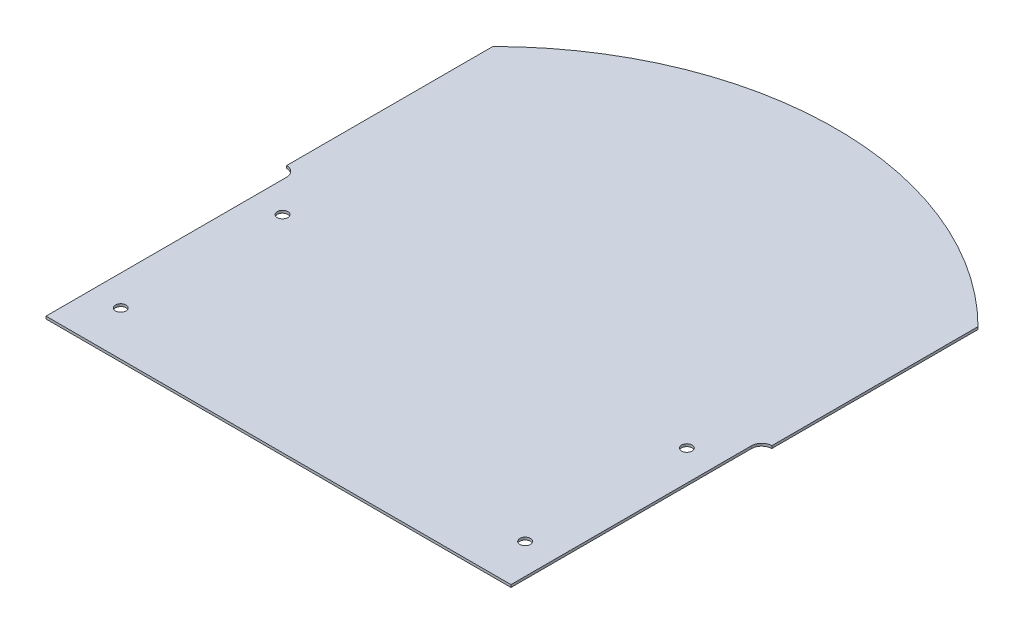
ISO-10303-21;
HEADER;
FILE_DESCRIPTION(('STEP AP214'),'2;1');
FILE_NAME('part.step','',(''),(''),'','','');
FILE_SCHEMA(('AUTOMOTIVE_DESIGN { 1 0 10303 214 1 1 1 1 }'));
ENDSEC;
DATA;
#1=APPLICATION_CONTEXT('core data for automotive mechanical design processes');
#2=APPLICATION_PROTOCOL_DEFINITION('international standard','automotive_design',2000,#1);
#3=PRODUCT_CONTEXT('',#1,'mechanical');
#4=PRODUCT('Part','Part','',(#3));
#5=PRODUCT_RELATED_PRODUCT_CATEGORY('part','',(#4));
#6=PRODUCT_DEFINITION_FORMATION('','',#4);
#7=PRODUCT_DEFINITION_CONTEXT('part definition',#1,'design');
#8=PRODUCT_DEFINITION('design','',#6,#7);
#9=PRODUCT_DEFINITION_SHAPE('','',#8);
#10=(LENGTH_UNIT() NAMED_UNIT(*) SI_UNIT(.MILLI.,.METRE.));
#11=(NAMED_UNIT(*) PLANE_ANGLE_UNIT() SI_UNIT($,.RADIAN.));
#12=(NAMED_UNIT(*) SI_UNIT($,.STERADIAN.) SOLID_ANGLE_UNIT());
#13=UNCERTAINTY_MEASURE_WITH_UNIT(LENGTH_MEASURE(1.E-05),#10,'distance_accuracy_value','');
#14=(GEOMETRIC_REPRESENTATION_CONTEXT(3) GLOBAL_UNCERTAINTY_ASSIGNED_CONTEXT((#13)) GLOBAL_UNIT_ASSIGNED_CONTEXT((#10,
#11,#12)) REPRESENTATION_CONTEXT('',''));
#15=CARTESIAN_POINT('',(0.,0.,0.));
#16=DIRECTION('',(0.,0.,1.));
#17=DIRECTION('',(1.,0.,0.));
#18=AXIS2_PLACEMENT_3D('',#15,#16,#17);
#19=CARTESIAN_POINT('',(-76.2,0.79375,39.37));
#20=DIRECTION('',(0.,0.,-1.));
#21=DIRECTION('',(-1.,0.,0.));
#22=AXIS2_PLACEMENT_3D('',#19,#20,#21);
#23=PLANE('',#22);
#24=DIRECTION('',(0.,-1.,0.));
#25=VECTOR('',#24,1.);
#26=CARTESIAN_POINT('',(73.025,0.79375,39.37));
#27=LINE('',#26,#25);
#28=CARTESIAN_POINT('',(73.025,0.79375,39.37));
#29=VERTEX_POINT('',#28);
#30=CARTESIAN_POINT('',(73.025,0.,39.37));
#31=VERTEX_POINT('',#30);
#32=EDGE_CURVE('E125',#29,#31,#27,.T.);
#33=ORIENTED_EDGE('',*,*,#32,.F.);
#34=DIRECTION('',(1.,0.,0.));
#35=VECTOR('',#34,1.);
#36=CARTESIAN_POINT('',(-76.2,0.79375,39.37));
#37=LINE('',#36,#35);
#38=CARTESIAN_POINT('',(-73.025,0.79375,39.37));
#39=VERTEX_POINT('',#38);
#40=EDGE_CURVE('E121',#39,#29,#37,.T.);
#41=ORIENTED_EDGE('',*,*,#40,.F.);
#42=DIRECTION('',(0.,-1.,0.));
#43=VECTOR('',#42,1.);
#44=CARTESIAN_POINT('',(-73.025,0.79375,39.37));
#45=LINE('',#44,#43);
#46=CARTESIAN_POINT('',(-73.025,0.,39.37));
#47=VERTEX_POINT('',#46);
#48=EDGE_CURVE('E137',#39,#47,#45,.T.);
#49=ORIENTED_EDGE('',*,*,#48,.T.);
#50=DIRECTION('',(1.,0.,0.));
#51=VECTOR('',#50,1.);
#52=CARTESIAN_POINT('',(-76.2,0.,39.37));
#53=LINE('',#52,#51);
#54=EDGE_CURVE('E162',#47,#31,#53,.T.);
#55=ORIENTED_EDGE('',*,*,#54,.T.);
#56=EDGE_LOOP('',(#33,#41,#49,#55));
#57=FACE_BOUND('',#56,.T.);
#58=ADVANCED_FACE('F35',(#57),#23,.F.);
#59=CARTESIAN_POINT('',(0.,0.79375,-27.9399999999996));
#60=DIRECTION('',(0.,1.,0.));
#61=DIRECTION('',(0.,0.,1.));
#62=AXIS2_PLACEMENT_3D('',#59,#60,#61);
#63=PLANE('',#62);
#64=CARTESIAN_POINT('',(63.5,0.79375,25.4));
#65=DIRECTION('',(0.,1.,0.));
#66=DIRECTION('',(0.,0.,1.));
#67=AXIS2_PLACEMENT_3D('',#64,#65,#66);
#68=CIRCLE('',#67,1.65100000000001);
#69=CARTESIAN_POINT('',(63.5,0.79375,27.051));
#70=VERTEX_POINT('',#69);
#71=EDGE_CURVE('E140',#70,#70,#68,.T.);
#72=ORIENTED_EDGE('',*,*,#71,.F.);
#73=EDGE_LOOP('',(#72));
#74=FACE_BOUND('',#73,.T.);
#75=CARTESIAN_POINT('',(63.5,0.79375,-25.4));
#76=DIRECTION('',(0.,1.,0.));
#77=DIRECTION('',(0.,0.,1.));
#78=AXIS2_PLACEMENT_3D('',#75,#76,#77);
#79=CIRCLE('',#78,1.65100000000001);
#80=CARTESIAN_POINT('',(63.5,0.79375,-23.749));
#81=VERTEX_POINT('',#80);
#82=EDGE_CURVE('E144',#81,#81,#79,.T.);
#83=ORIENTED_EDGE('',*,*,#82,.F.);
#84=EDGE_LOOP('',(#83));
#85=FACE_BOUND('',#84,.T.);
#86=CARTESIAN_POINT('',(-63.5,0.79375,-25.4));
#87=DIRECTION('',(0.,1.,0.));
#88=DIRECTION('',(0.,0.,1.));
#89=AXIS2_PLACEMENT_3D('',#86,#87,#88);
#90=CIRCLE('',#89,1.651);
#91=CARTESIAN_POINT('',(-63.5,0.79375,-23.749));
#92=VERTEX_POINT('',#91);
#93=EDGE_CURVE('E150',#92,#92,#90,.T.);
#94=ORIENTED_EDGE('',*,*,#93,.F.);
#95=EDGE_LOOP('',(#94));
#96=FACE_BOUND('',#95,.T.);
#97=CARTESIAN_POINT('',(-63.5,0.79375,25.4));
#98=DIRECTION('',(0.,1.,0.));
#99=DIRECTION('',(0.,0.,1.));
#100=AXIS2_PLACEMENT_3D('',#97,#98,#99);
#101=CIRCLE('',#100,1.651);
#102=CARTESIAN_POINT('',(-63.5,0.79375,27.051));
#103=VERTEX_POINT('',#102);
#104=EDGE_CURVE('E159',#103,#103,#101,.T.);
#105=ORIENTED_EDGE('',*,*,#104,.F.);
#106=EDGE_LOOP('',(#105));
#107=FACE_BOUND('',#106,.T.);
#108=DIRECTION('',(0.,0.,1.));
#109=VECTOR('',#108,1.);
#110=CARTESIAN_POINT('',(73.025,0.79375,-39.37));
#111=LINE('',#110,#109);
#112=CARTESIAN_POINT('',(73.025,0.79375,-36.195));
#113=VERTEX_POINT('',#112);
#114=EDGE_CURVE('E106',#113,#29,#111,.T.);
#115=ORIENTED_EDGE('',*,*,#114,.F.);
#116=CARTESIAN_POINT('',(76.2,0.79375,-36.195));
#117=DIRECTION('',(0.,1.,0.));
#118=DIRECTION('',(0.,0.,1.));
#119=AXIS2_PLACEMENT_3D('',#116,#117,#118);
#120=CIRCLE('',#119,3.175);
#121=CARTESIAN_POINT('',(76.2,0.79375,-39.37));
#122=VERTEX_POINT('',#121);
#123=EDGE_CURVE('E99',#113,#122,#120,.F.);
#124=ORIENTED_EDGE('',*,*,#123,.T.);
#125=DIRECTION('',(0.,0.,-1.));
#126=VECTOR('',#125,1.);
#127=CARTESIAN_POINT('',(76.2,0.79375,39.37));
#128=LINE('',#127,#126);
#129=CARTESIAN_POINT('',(76.2,0.79375,-104.14));
#130=VERTEX_POINT('',#129);
#131=EDGE_CURVE('E103',#122,#130,#128,.T.);
#132=ORIENTED_EDGE('',*,*,#131,.T.);
#133=CARTESIAN_POINT('',(0.,0.79375,-27.9399999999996));
#134=DIRECTION('',(0.,1.,0.));
#135=DIRECTION('',(0.,0.,1.));
#136=AXIS2_PLACEMENT_3D('',#133,#134,#135);
#137=CIRCLE('',#136,107.76307345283);
#138=CARTESIAN_POINT('',(-76.2,0.79375,-104.14));
#139=VERTEX_POINT('',#138);
#140=EDGE_CURVE('E120',#130,#139,#137,.T.);
#141=ORIENTED_EDGE('',*,*,#140,.T.);
#142=DIRECTION('',(0.,0.,-1.));
#143=VECTOR('',#142,1.);
#144=CARTESIAN_POINT('',(-76.2,0.79375,39.37));
#145=LINE('',#144,#143);
#146=CARTESIAN_POINT('',(-76.2,0.79375,-39.37));
#147=VERTEX_POINT('',#146);
#148=EDGE_CURVE('E168',#147,#139,#145,.T.);
#149=ORIENTED_EDGE('',*,*,#148,.F.);
#150=CARTESIAN_POINT('',(-76.2,0.79375,-36.195));
#151=DIRECTION('',(0.,1.,0.));
#152=DIRECTION('',(0.,0.,1.));
#153=AXIS2_PLACEMENT_3D('',#150,#151,#152);
#154=CIRCLE('',#153,3.175);
#155=CARTESIAN_POINT('',(-73.025,0.79375,-36.195));
#156=VERTEX_POINT('',#155);
#157=EDGE_CURVE('E11',#147,#156,#154,.F.);
#158=ORIENTED_EDGE('',*,*,#157,.T.);
#159=DIRECTION('',(0.,0.,-1.));
#160=VECTOR('',#159,1.);
#161=CARTESIAN_POINT('',(-73.025,0.79375,-39.37));
#162=LINE('',#161,#160);
#163=EDGE_CURVE('E128',#39,#156,#162,.T.);
#164=ORIENTED_EDGE('',*,*,#163,.F.);
#165=ORIENTED_EDGE('',*,*,#40,.T.);
#166=EDGE_LOOP('',(#115,#124,#132,#141,#149,#158,#164,#165));
#167=FACE_BOUND('',#166,.T.);
#168=ADVANCED_FACE('F101',(#74,#85,#96,#107,#167),#63,.T.);
#169=CARTESIAN_POINT('',(0.,0.,-27.9399999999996));
#170=DIRECTION('',(0.,1.,0.));
#171=DIRECTION('',(0.,0.,1.));
#172=AXIS2_PLACEMENT_3D('',#169,#170,#171);
#173=PLANE('',#172);
#174=CARTESIAN_POINT('',(63.5,0.,25.4));
#175=DIRECTION('',(0.,1.,0.));
#176=DIRECTION('',(0.,0.,1.));
#177=AXIS2_PLACEMENT_3D('',#174,#175,#176);
#178=CIRCLE('',#177,1.65100000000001);
#179=CARTESIAN_POINT('',(63.5,0.,27.051));
#180=VERTEX_POINT('',#179);
#181=EDGE_CURVE('E141',#180,#180,#178,.T.);
#182=ORIENTED_EDGE('',*,*,#181,.T.);
#183=EDGE_LOOP('',(#182));
#184=FACE_BOUND('',#183,.T.);
#185=CARTESIAN_POINT('',(63.5,0.,-25.4));
#186=DIRECTION('',(0.,1.,0.));
#187=DIRECTION('',(0.,0.,1.));
#188=AXIS2_PLACEMENT_3D('',#185,#186,#187);
#189=CIRCLE('',#188,1.65100000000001);
#190=CARTESIAN_POINT('',(63.5,0.,-23.749));
#191=VERTEX_POINT('',#190);
#192=EDGE_CURVE('E147',#191,#191,#189,.T.);
#193=ORIENTED_EDGE('',*,*,#192,.T.);
#194=EDGE_LOOP('',(#193));
#195=FACE_BOUND('',#194,.T.);
#196=CARTESIAN_POINT('',(-63.5,0.,-25.4));
#197=DIRECTION('',(0.,1.,0.));
#198=DIRECTION('',(0.,0.,1.));
#199=AXIS2_PLACEMENT_3D('',#196,#197,#198);
#200=CIRCLE('',#199,1.651);
#201=CARTESIAN_POINT('',(-63.5,0.,-23.749));
#202=VERTEX_POINT('',#201);
#203=EDGE_CURVE('E153',#202,#202,#200,.T.);
#204=ORIENTED_EDGE('',*,*,#203,.T.);
#205=EDGE_LOOP('',(#204));
#206=FACE_BOUND('',#205,.T.);
#207=CARTESIAN_POINT('',(-63.5,0.,25.4));
#208=DIRECTION('',(0.,1.,0.));
#209=DIRECTION('',(0.,0.,1.));
#210=AXIS2_PLACEMENT_3D('',#207,#208,#209);
#211=CIRCLE('',#210,1.651);
#212=CARTESIAN_POINT('',(-63.5,0.,27.051));
#213=VERTEX_POINT('',#212);
#214=EDGE_CURVE('E156',#213,#213,#211,.T.);
#215=ORIENTED_EDGE('',*,*,#214,.T.);
#216=EDGE_LOOP('',(#215));
#217=FACE_BOUND('',#216,.T.);
#218=DIRECTION('',(0.,0.,-1.));
#219=VECTOR('',#218,1.);
#220=CARTESIAN_POINT('',(76.2,0.,39.37));
#221=LINE('',#220,#219);
#222=CARTESIAN_POINT('',(76.2,0.,-39.37));
#223=VERTEX_POINT('',#222);
#224=CARTESIAN_POINT('',(76.2,0.,-104.14));
#225=VERTEX_POINT('',#224);
#226=EDGE_CURVE('E173',#223,#225,#221,.T.);
#227=ORIENTED_EDGE('',*,*,#226,.F.);
#228=CARTESIAN_POINT('',(76.2,0.,-36.195));
#229=DIRECTION('',(0.,1.,0.));
#230=DIRECTION('',(0.,0.,1.));
#231=AXIS2_PLACEMENT_3D('',#228,#229,#230);
#232=CIRCLE('',#231,3.175);
#233=CARTESIAN_POINT('',(73.025,0.,-36.195));
#234=VERTEX_POINT('',#233);
#235=EDGE_CURVE('E110',#223,#234,#232,.T.);
#236=ORIENTED_EDGE('',*,*,#235,.T.);
#237=DIRECTION('',(0.,0.,1.));
#238=VECTOR('',#237,1.);
#239=CARTESIAN_POINT('',(73.025,0.,-39.37));
#240=LINE('',#239,#238);
#241=EDGE_CURVE('E202',#234,#31,#240,.T.);
#242=ORIENTED_EDGE('',*,*,#241,.T.);
#243=ORIENTED_EDGE('',*,*,#54,.F.);
#244=DIRECTION('',(0.,0.,-1.));
#245=VECTOR('',#244,1.);
#246=CARTESIAN_POINT('',(-73.025,0.,-39.37));
#247=LINE('',#246,#245);
#248=CARTESIAN_POINT('',(-73.025,0.,-36.195));
#249=VERTEX_POINT('',#248);
#250=EDGE_CURVE('E124',#47,#249,#247,.T.);
#251=ORIENTED_EDGE('',*,*,#250,.T.);
#252=CARTESIAN_POINT('',(-76.2,0.,-36.195));
#253=DIRECTION('',(0.,1.,0.));
#254=DIRECTION('',(0.,0.,1.));
#255=AXIS2_PLACEMENT_3D('',#252,#253,#254);
#256=CIRCLE('',#255,3.175);
#257=CARTESIAN_POINT('',(-76.2,0.,-39.37));
#258=VERTEX_POINT('',#257);
#259=EDGE_CURVE('E43',#249,#258,#256,.T.);
#260=ORIENTED_EDGE('',*,*,#259,.T.);
#261=DIRECTION('',(0.,0.,-1.));
#262=VECTOR('',#261,1.);
#263=CARTESIAN_POINT('',(-76.2,0.,39.37));
#264=LINE('',#263,#262);
#265=CARTESIAN_POINT('',(-76.2,0.,-104.14));
#266=VERTEX_POINT('',#265);
#267=EDGE_CURVE('E165',#258,#266,#264,.T.);
#268=ORIENTED_EDGE('',*,*,#267,.T.);
#269=CARTESIAN_POINT('',(0.,0.,-27.9399999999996));
#270=DIRECTION('',(0.,1.,0.));
#271=DIRECTION('',(0.,0.,1.));
#272=AXIS2_PLACEMENT_3D('',#269,#270,#271);
#273=CIRCLE('',#272,107.76307345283);
#274=EDGE_CURVE('E175',#225,#266,#273,.T.);
#275=ORIENTED_EDGE('',*,*,#274,.F.);
#276=EDGE_LOOP('',(#227,#236,#242,#243,#251,#260,#268,#275));
#277=FACE_BOUND('',#276,.T.);
#278=ADVANCED_FACE('F188',(#184,#195,#206,#217,#277),#173,.F.);
#279=CARTESIAN_POINT('',(76.2,0.79375,39.37));
#280=DIRECTION('',(-1.,0.,0.));
#281=DIRECTION('',(0.,0.,1.));
#282=AXIS2_PLACEMENT_3D('',#279,#280,#281);
#283=PLANE('',#282);
#284=DIRECTION('',(0.,-1.,0.));
#285=VECTOR('',#284,1.);
#286=CARTESIAN_POINT('',(76.2,0.79375,-39.37));
#287=LINE('',#286,#285);
#288=EDGE_CURVE('E115',#122,#223,#287,.T.);
#289=ORIENTED_EDGE('',*,*,#288,.T.);
#290=ORIENTED_EDGE('',*,*,#226,.T.);
#291=DIRECTION('',(0.,-1.,0.));
#292=VECTOR('',#291,1.);
#293=CARTESIAN_POINT('',(76.2,0.79375,-104.14));
#294=LINE('',#293,#292);
#295=EDGE_CURVE('E118',#130,#225,#294,.T.);
#296=ORIENTED_EDGE('',*,*,#295,.F.);
#297=ORIENTED_EDGE('',*,*,#131,.F.);
#298=EDGE_LOOP('',(#289,#290,#296,#297));
#299=FACE_BOUND('',#298,.T.);
#300=ADVANCED_FACE('F114',(#299),#283,.F.);
#301=CARTESIAN_POINT('',(-76.2,0.79375,39.37));
#302=DIRECTION('',(-1.,0.,0.));
#303=DIRECTION('',(0.,0.,1.));
#304=AXIS2_PLACEMENT_3D('',#301,#302,#303);
#305=PLANE('',#304);
#306=ORIENTED_EDGE('',*,*,#267,.F.);
#307=DIRECTION('',(0.,-1.,0.));
#308=VECTOR('',#307,1.);
#309=CARTESIAN_POINT('',(-76.2,0.79375,-39.37));
#310=LINE('',#309,#308);
#311=EDGE_CURVE('E134',#147,#258,#310,.T.);
#312=ORIENTED_EDGE('',*,*,#311,.F.);
#313=ORIENTED_EDGE('',*,*,#148,.T.);
#314=DIRECTION('',(0.,-1.,0.));
#315=VECTOR('',#314,1.);
#316=CARTESIAN_POINT('',(-76.2,0.79375,-104.14));
#317=LINE('',#316,#315);
#318=EDGE_CURVE('E170',#139,#266,#317,.T.);
#319=ORIENTED_EDGE('',*,*,#318,.T.);
#320=EDGE_LOOP('',(#306,#312,#313,#319));
#321=FACE_BOUND('',#320,.T.);
#322=ADVANCED_FACE('F192',(#321),#305,.T.);
#323=CARTESIAN_POINT('',(0.,0.79375,-27.9399999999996));
#324=DIRECTION('',(0.,-1.,0.));
#325=DIRECTION('',(0.,0.,-1.));
#326=AXIS2_PLACEMENT_3D('',#323,#324,#325);
#327=CYLINDRICAL_SURFACE('',#326,107.76307345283);
#328=ORIENTED_EDGE('',*,*,#274,.T.);
#329=ORIENTED_EDGE('',*,*,#318,.F.);
#330=ORIENTED_EDGE('',*,*,#140,.F.);
#331=ORIENTED_EDGE('',*,*,#295,.T.);
#332=EDGE_LOOP('',(#328,#329,#330,#331));
#333=FACE_BOUND('',#332,.T.);
#334=ADVANCED_FACE('F205',(#333),#327,.T.);
#335=CARTESIAN_POINT('',(-63.5,0.79375,25.4));
#336=DIRECTION('',(0.,-1.,0.));
#337=DIRECTION('',(0.,0.,-1.));
#338=AXIS2_PLACEMENT_3D('',#335,#336,#337);
#339=CYLINDRICAL_SURFACE('',#338,1.651);
#340=ORIENTED_EDGE('',*,*,#104,.T.);
#341=EDGE_LOOP('',(#340));
#342=FACE_BOUND('',#341,.T.);
#343=ORIENTED_EDGE('',*,*,#214,.F.);
#344=EDGE_LOOP('',(#343));
#345=FACE_BOUND('',#344,.T.);
#346=ADVANCED_FACE('F207',(#342,#345),#339,.F.);
#347=CARTESIAN_POINT('',(-63.5,0.79375,-25.4));
#348=DIRECTION('',(0.,-1.,0.));
#349=DIRECTION('',(0.,0.,-1.));
#350=AXIS2_PLACEMENT_3D('',#347,#348,#349);
#351=CYLINDRICAL_SURFACE('',#350,1.651);
#352=ORIENTED_EDGE('',*,*,#93,.T.);
#353=EDGE_LOOP('',(#352));
#354=FACE_BOUND('',#353,.T.);
#355=ORIENTED_EDGE('',*,*,#203,.F.);
#356=EDGE_LOOP('',(#355));
#357=FACE_BOUND('',#356,.T.);
#358=ADVANCED_FACE('F213',(#354,#357),#351,.F.);
#359=CARTESIAN_POINT('',(63.5,0.79375,-25.4));
#360=DIRECTION('',(0.,-1.,0.));
#361=DIRECTION('',(0.,0.,-1.));
#362=AXIS2_PLACEMENT_3D('',#359,#360,#361);
#363=CYLINDRICAL_SURFACE('',#362,1.65100000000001);
#364=ORIENTED_EDGE('',*,*,#82,.T.);
#365=EDGE_LOOP('',(#364));
#366=FACE_BOUND('',#365,.T.);
#367=ORIENTED_EDGE('',*,*,#192,.F.);
#368=EDGE_LOOP('',(#367));
#369=FACE_BOUND('',#368,.T.);
#370=ADVANCED_FACE('F239',(#366,#369),#363,.F.);
#371=CARTESIAN_POINT('',(63.5,0.79375,25.4));
#372=DIRECTION('',(0.,-1.,0.));
#373=DIRECTION('',(0.,0.,-1.));
#374=AXIS2_PLACEMENT_3D('',#371,#372,#373);
#375=CYLINDRICAL_SURFACE('',#374,1.65100000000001);
#376=ORIENTED_EDGE('',*,*,#71,.T.);
#377=EDGE_LOOP('',(#376));
#378=FACE_BOUND('',#377,.T.);
#379=ORIENTED_EDGE('',*,*,#181,.F.);
#380=EDGE_LOOP('',(#379));
#381=FACE_BOUND('',#380,.T.);
#382=ADVANCED_FACE('F234',(#378,#381),#375,.F.);
#383=CARTESIAN_POINT('',(-73.025,0.79375,-39.37));
#384=DIRECTION('',(-1.,0.,0.));
#385=DIRECTION('',(0.,0.,1.));
#386=AXIS2_PLACEMENT_3D('',#383,#384,#385);
#387=PLANE('',#386);
#388=ORIENTED_EDGE('',*,*,#163,.T.);
#389=DIRECTION('',(0.,-1.,0.));
#390=VECTOR('',#389,1.);
#391=CARTESIAN_POINT('',(-73.025,0.,-36.195));
#392=LINE('',#391,#390);
#393=EDGE_CURVE('E184',#156,#249,#392,.T.);
#394=ORIENTED_EDGE('',*,*,#393,.T.);
#395=ORIENTED_EDGE('',*,*,#250,.F.);
#396=ORIENTED_EDGE('',*,*,#48,.F.);
#397=EDGE_LOOP('',(#388,#394,#395,#396));
#398=FACE_BOUND('',#397,.T.);
#399=ADVANCED_FACE('F195',(#398),#387,.T.);
#400=CARTESIAN_POINT('',(73.025,0.79375,-39.37));
#401=DIRECTION('',(1.,0.,0.));
#402=DIRECTION('',(0.,0.,-1.));
#403=AXIS2_PLACEMENT_3D('',#400,#401,#402);
#404=PLANE('',#403);
#405=ORIENTED_EDGE('',*,*,#241,.F.);
#406=DIRECTION('',(0.,-1.,0.));
#407=VECTOR('',#406,1.);
#408=CARTESIAN_POINT('',(73.025,0.79375,-36.195));
#409=LINE('',#408,#407);
#410=EDGE_CURVE('E182',#234,#113,#409,.F.);
#411=ORIENTED_EDGE('',*,*,#410,.T.);
#412=ORIENTED_EDGE('',*,*,#114,.T.);
#413=ORIENTED_EDGE('',*,*,#32,.T.);
#414=EDGE_LOOP('',(#405,#411,#412,#413));
#415=FACE_BOUND('',#414,.T.);
#416=ADVANCED_FACE('F201',(#415),#404,.T.);
#417=CARTESIAN_POINT('',(76.2,0.79375,-36.195));
#418=DIRECTION('',(0.,1.,0.));
#419=DIRECTION('',(0.,0.,1.));
#420=AXIS2_PLACEMENT_3D('',#417,#418,#419);
#421=CYLINDRICAL_SURFACE('',#420,3.175);
#422=ORIENTED_EDGE('',*,*,#123,.F.);
#423=ORIENTED_EDGE('',*,*,#410,.F.);
#424=ORIENTED_EDGE('',*,*,#235,.F.);
#425=ORIENTED_EDGE('',*,*,#288,.F.);
#426=EDGE_LOOP('',(#422,#423,#424,#425));
#427=FACE_BOUND('',#426,.T.);
#428=ADVANCED_FACE('F123',(#427),#421,.F.);
#429=CARTESIAN_POINT('',(-76.2,0.79375,-36.195));
#430=DIRECTION('',(0.,1.,0.));
#431=DIRECTION('',(0.,0.,1.));
#432=AXIS2_PLACEMENT_3D('',#429,#430,#431);
#433=CYLINDRICAL_SURFACE('',#432,3.175);
#434=ORIENTED_EDGE('',*,*,#157,.F.);
#435=ORIENTED_EDGE('',*,*,#311,.T.);
#436=ORIENTED_EDGE('',*,*,#259,.F.);
#437=ORIENTED_EDGE('',*,*,#393,.F.);
#438=EDGE_LOOP('',(#434,#435,#436,#437));
#439=FACE_BOUND('',#438,.T.);
#440=ADVANCED_FACE('F37',(#439),#433,.F.);
#441=CLOSED_SHELL('',(#58,#168,#278,#300,#322,#334,#346,#358,#370,#382,#399,#416,#428,#440));
#442=MANIFOLD_SOLID_BREP('B2',#441);
#443=ADVANCED_BREP_SHAPE_REPRESENTATION('',(#18,#442),#14);
#444=SHAPE_DEFINITION_REPRESENTATION(#9,#443);
ENDSEC;
END-ISO-10303-21;
